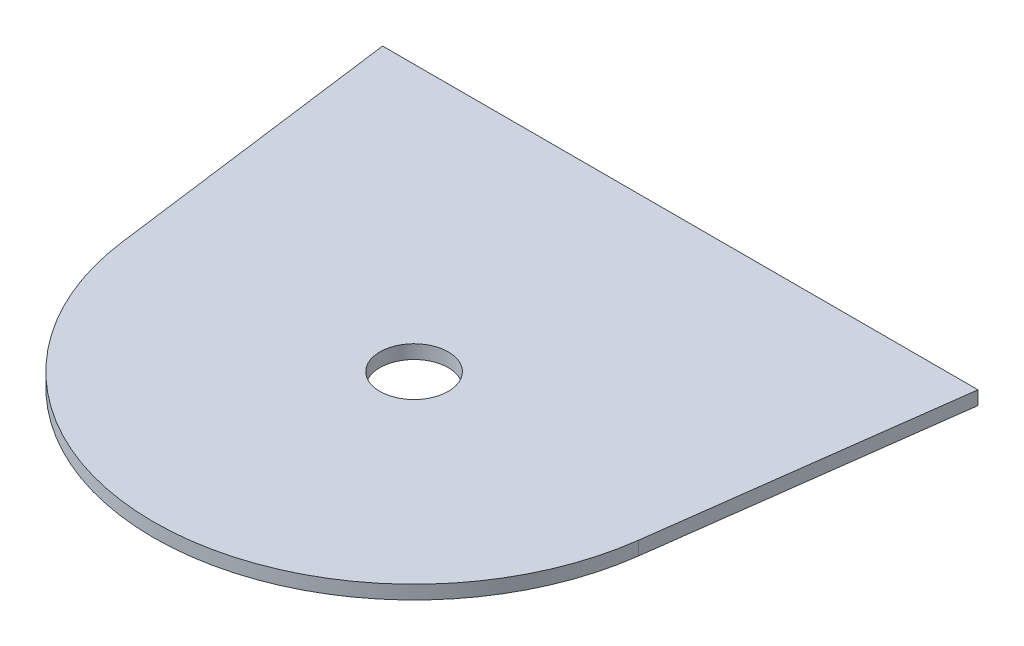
ISO-10303-21;
HEADER;
FILE_DESCRIPTION(('STEP AP214'),'2;1');
FILE_NAME('part.step','',(''),(''),'','','');
FILE_SCHEMA(('AUTOMOTIVE_DESIGN { 1 0 10303 214 1 1 1 1 }'));
ENDSEC;
DATA;
#1=APPLICATION_CONTEXT('core data for automotive mechanical design processes');
#2=APPLICATION_PROTOCOL_DEFINITION('international standard','automotive_design',2000,#1);
#3=PRODUCT_CONTEXT('',#1,'mechanical');
#4=PRODUCT('Part','Part','',(#3));
#5=PRODUCT_RELATED_PRODUCT_CATEGORY('part','',(#4));
#6=PRODUCT_DEFINITION_FORMATION('','',#4);
#7=PRODUCT_DEFINITION_CONTEXT('part definition',#1,'design');
#8=PRODUCT_DEFINITION('design','',#6,#7);
#9=PRODUCT_DEFINITION_SHAPE('','',#8);
#10=(LENGTH_UNIT() NAMED_UNIT(*) SI_UNIT(.MILLI.,.METRE.));
#11=(NAMED_UNIT(*) PLANE_ANGLE_UNIT() SI_UNIT($,.RADIAN.));
#12=(NAMED_UNIT(*) SI_UNIT($,.STERADIAN.) SOLID_ANGLE_UNIT());
#13=UNCERTAINTY_MEASURE_WITH_UNIT(LENGTH_MEASURE(1.E-05),#10,'distance_accuracy_value','');
#14=(GEOMETRIC_REPRESENTATION_CONTEXT(3) GLOBAL_UNCERTAINTY_ASSIGNED_CONTEXT((#13)) GLOBAL_UNIT_ASSIGNED_CONTEXT((#10,
#11,#12)) REPRESENTATION_CONTEXT('',''));
#15=CARTESIAN_POINT('',(0.,0.,0.));
#16=DIRECTION('',(0.,0.,1.));
#17=DIRECTION('',(1.,0.,0.));
#18=AXIS2_PLACEMENT_3D('',#15,#16,#17);
#19=CARTESIAN_POINT('',(0.,2.,0.));
#20=DIRECTION('',(0.,1.,0.));
#21=DIRECTION('',(0.,0.,1.));
#22=AXIS2_PLACEMENT_3D('',#19,#20,#21);
#23=PLANE('',#22);
#24=CARTESIAN_POINT('',(0.,2.,0.));
#25=DIRECTION('',(0.,1.,0.));
#26=DIRECTION('',(0.,0.,1.));
#27=AXIS2_PLACEMENT_3D('',#24,#25,#26);
#28=CIRCLE('',#27,5.);
#29=CARTESIAN_POINT('',(0.,2.,5.));
#30=VERTEX_POINT('',#29);
#31=EDGE_CURVE('E96',#30,#30,#28,.F.);
#32=ORIENTED_EDGE('',*,*,#31,.T.);
#33=EDGE_LOOP('',(#32));
#34=FACE_BOUND('',#33,.T.);
#35=DIRECTION('',(-1.,0.,0.));
#36=VECTOR('',#35,1.);
#37=CARTESIAN_POINT('',(43.5,2.,-38.90293115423));
#38=LINE('',#37,#36);
#39=CARTESIAN_POINT('',(-43.5,2.,-38.90293115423));
#40=VERTEX_POINT('',#39);
#41=CARTESIAN_POINT('',(43.4999999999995,2.,-38.9029311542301));
#42=VERTEX_POINT('',#41);
#43=EDGE_CURVE('E69',#40,#42,#38,.F.);
#44=ORIENTED_EDGE('',*,*,#43,.F.);
#45=DIRECTION('',(0.130526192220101,0.,0.991444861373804));
#46=VECTOR('',#45,1.);
#47=CARTESIAN_POINT('',(-43.5,2.,-38.90293115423));
#48=LINE('',#47,#46);
#49=CARTESIAN_POINT('',(-37.7244769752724,2.,4.96652161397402));
#50=VERTEX_POINT('',#49);
#51=EDGE_CURVE('E67',#50,#40,#48,.F.);
#52=ORIENTED_EDGE('',*,*,#51,.F.);
#53=CARTESIAN_POINT('',(0.,2.,0.));
#54=DIRECTION('',(0.,1.,0.));
#55=DIRECTION('',(0.,0.,1.));
#56=AXIS2_PLACEMENT_3D('',#53,#54,#55);
#57=CIRCLE('',#56,38.05);
#58=CARTESIAN_POINT('',(37.7244769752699,2.,4.96652161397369));
#59=VERTEX_POINT('',#58);
#60=EDGE_CURVE('E20',#59,#50,#57,.F.);
#61=ORIENTED_EDGE('',*,*,#60,.F.);
#62=DIRECTION('',(0.130526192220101,0.,-0.991444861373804));
#63=VECTOR('',#62,1.);
#64=CARTESIAN_POINT('',(37.72447697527,2.,4.966521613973));
#65=LINE('',#64,#63);
#66=EDGE_CURVE('E54',#42,#59,#65,.F.);
#67=ORIENTED_EDGE('',*,*,#66,.F.);
#68=EDGE_LOOP('',(#44,#52,#61,#67));
#69=FACE_BOUND('',#68,.T.);
#70=ADVANCED_FACE('F17',(#34,#69),#23,.T.);
#71=CARTESIAN_POINT('',(-43.5,0.,-38.90293115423));
#72=DIRECTION('',(-0.991444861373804,0.,0.130526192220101));
#73=DIRECTION('',(0.130526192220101,0.,0.991444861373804));
#74=AXIS2_PLACEMENT_3D('',#71,#72,#73);
#75=PLANE('',#74);
#76=DIRECTION('',(0.,1.,0.));
#77=VECTOR('',#76,1.);
#78=CARTESIAN_POINT('',(-43.5,0.,-38.90293115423));
#79=LINE('',#78,#77);
#80=CARTESIAN_POINT('',(-43.5,0.,-38.90293115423));
#81=VERTEX_POINT('',#80);
#82=EDGE_CURVE('E83',#81,#40,#79,.T.);
#83=ORIENTED_EDGE('',*,*,#82,.F.);
#84=DIRECTION('',(0.130526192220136,0.,0.991444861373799));
#85=VECTOR('',#84,1.);
#86=CARTESIAN_POINT('',(-43.5,0.,-38.90293115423));
#87=LINE('',#86,#85);
#88=CARTESIAN_POINT('',(-37.7244769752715,0.,4.96652161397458));
#89=VERTEX_POINT('',#88);
#90=EDGE_CURVE('E76',#81,#89,#87,.T.);
#91=ORIENTED_EDGE('',*,*,#90,.T.);
#92=DIRECTION('',(0.,1.,0.));
#93=VECTOR('',#92,1.);
#94=CARTESIAN_POINT('',(-37.7244769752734,0.,4.96652161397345));
#95=LINE('',#94,#93);
#96=EDGE_CURVE('E63',#50,#89,#95,.F.);
#97=ORIENTED_EDGE('',*,*,#96,.F.);
#98=ORIENTED_EDGE('',*,*,#51,.T.);
#99=EDGE_LOOP('',(#83,#91,#97,#98));
#100=FACE_BOUND('',#99,.T.);
#101=ADVANCED_FACE('F75',(#100),#75,.T.);
#102=CARTESIAN_POINT('',(0.,0.,0.));
#103=DIRECTION('',(0.,1.,0.));
#104=DIRECTION('',(0.,0.,1.));
#105=AXIS2_PLACEMENT_3D('',#102,#103,#104);
#106=CYLINDRICAL_SURFACE('',#105,38.05);
#107=ORIENTED_EDGE('',*,*,#96,.T.);
#108=CARTESIAN_POINT('',(0.,0.,0.));
#109=DIRECTION('',(0.,1.,0.));
#110=DIRECTION('',(0.,0.,1.));
#111=AXIS2_PLACEMENT_3D('',#108,#109,#110);
#112=CIRCLE('',#111,38.05);
#113=CARTESIAN_POINT('',(37.7244769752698,0.,4.96652161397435));
#114=VERTEX_POINT('',#113);
#115=EDGE_CURVE('E94',#89,#114,#112,.T.);
#116=ORIENTED_EDGE('',*,*,#115,.T.);
#117=DIRECTION('',(0.,1.,0.));
#118=VECTOR('',#117,1.);
#119=CARTESIAN_POINT('',(37.72447697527,0.,4.966521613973));
#120=LINE('',#119,#118);
#121=EDGE_CURVE('E65',#59,#114,#120,.F.);
#122=ORIENTED_EDGE('',*,*,#121,.F.);
#123=ORIENTED_EDGE('',*,*,#60,.T.);
#124=EDGE_LOOP('',(#107,#116,#122,#123));
#125=FACE_BOUND('',#124,.T.);
#126=ADVANCED_FACE('F60',(#125),#106,.T.);
#127=CARTESIAN_POINT('',(37.72447697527,0.,4.966521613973));
#128=DIRECTION('',(0.991444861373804,0.,0.130526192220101));
#129=DIRECTION('',(0.130526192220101,0.,-0.991444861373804));
#130=AXIS2_PLACEMENT_3D('',#127,#128,#129);
#131=PLANE('',#130);
#132=ORIENTED_EDGE('',*,*,#121,.T.);
#133=DIRECTION('',(0.130526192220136,0.,-0.991444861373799));
#134=VECTOR('',#133,1.);
#135=CARTESIAN_POINT('',(37.72447697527,0.,4.966521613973));
#136=LINE('',#135,#134);
#137=CARTESIAN_POINT('',(43.5,0.,-38.90293115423));
#138=VERTEX_POINT('',#137);
#139=EDGE_CURVE('E95',#114,#138,#136,.T.);
#140=ORIENTED_EDGE('',*,*,#139,.T.);
#141=DIRECTION('',(0.,1.,0.));
#142=VECTOR('',#141,1.);
#143=CARTESIAN_POINT('',(43.5,0.,-38.90293115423));
#144=LINE('',#143,#142);
#145=EDGE_CURVE('E35',#42,#138,#144,.F.);
#146=ORIENTED_EDGE('',*,*,#145,.F.);
#147=ORIENTED_EDGE('',*,*,#66,.T.);
#148=EDGE_LOOP('',(#132,#140,#146,#147));
#149=FACE_BOUND('',#148,.T.);
#150=ADVANCED_FACE('F112',(#149),#131,.T.);
#151=CARTESIAN_POINT('',(43.5,0.,-38.90293115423));
#152=DIRECTION('',(0.,0.,-1.));
#153=DIRECTION('',(-1.,0.,0.));
#154=AXIS2_PLACEMENT_3D('',#151,#152,#153);
#155=PLANE('',#154);
#156=ORIENTED_EDGE('',*,*,#145,.T.);
#157=DIRECTION('',(1.,0.,0.));
#158=VECTOR('',#157,1.);
#159=CARTESIAN_POINT('',(0.,0.,-38.90293115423));
#160=LINE('',#159,#158);
#161=EDGE_CURVE('E26',#138,#81,#160,.F.);
#162=ORIENTED_EDGE('',*,*,#161,.T.);
#163=ORIENTED_EDGE('',*,*,#82,.T.);
#164=ORIENTED_EDGE('',*,*,#43,.T.);
#165=EDGE_LOOP('',(#156,#162,#163,#164));
#166=FACE_BOUND('',#165,.T.);
#167=ADVANCED_FACE('F115',(#166),#155,.T.);
#168=CARTESIAN_POINT('',(0.,2.,0.));
#169=DIRECTION('',(0.,1.,0.));
#170=DIRECTION('',(0.,0.,1.));
#171=AXIS2_PLACEMENT_3D('',#168,#169,#170);
#172=CYLINDRICAL_SURFACE('',#171,5.);
#173=ORIENTED_EDGE('',*,*,#31,.F.);
#174=EDGE_LOOP('',(#173));
#175=FACE_BOUND('',#174,.T.);
#176=CARTESIAN_POINT('',(0.,0.,0.));
#177=DIRECTION('',(0.,1.,0.));
#178=DIRECTION('',(0.,0.,1.));
#179=AXIS2_PLACEMENT_3D('',#176,#177,#178);
#180=CIRCLE('',#179,5.);
#181=CARTESIAN_POINT('',(0.,0.,5.));
#182=VERTEX_POINT('',#181);
#183=EDGE_CURVE('E11',#182,#182,#180,.F.);
#184=ORIENTED_EDGE('',*,*,#183,.T.);
#185=EDGE_LOOP('',(#184));
#186=FACE_BOUND('',#185,.T.);
#187=ADVANCED_FACE('F117',(#175,#186),#172,.F.);
#188=CARTESIAN_POINT('',(0.,0.,0.));
#189=DIRECTION('',(0.,1.,0.));
#190=DIRECTION('',(0.,0.,1.));
#191=AXIS2_PLACEMENT_3D('',#188,#189,#190);
#192=PLANE('',#191);
#193=ORIENTED_EDGE('',*,*,#183,.F.);
#194=EDGE_LOOP('',(#193));
#195=FACE_BOUND('',#194,.T.);
#196=ORIENTED_EDGE('',*,*,#139,.F.);
#197=ORIENTED_EDGE('',*,*,#115,.F.);
#198=ORIENTED_EDGE('',*,*,#90,.F.);
#199=ORIENTED_EDGE('',*,*,#161,.F.);
#200=EDGE_LOOP('',(#196,#197,#198,#199));
#201=FACE_BOUND('',#200,.T.);
#202=ADVANCED_FACE('F114',(#195,#201),#192,.F.);
#203=CLOSED_SHELL('',(#70,#101,#126,#150,#167,#187,#202));
#204=MANIFOLD_SOLID_BREP('B1',#203);
#205=ADVANCED_BREP_SHAPE_REPRESENTATION('',(#18,#204),#14);
#206=SHAPE_DEFINITION_REPRESENTATION(#9,#205);
ENDSEC;
END-ISO-10303-21;
